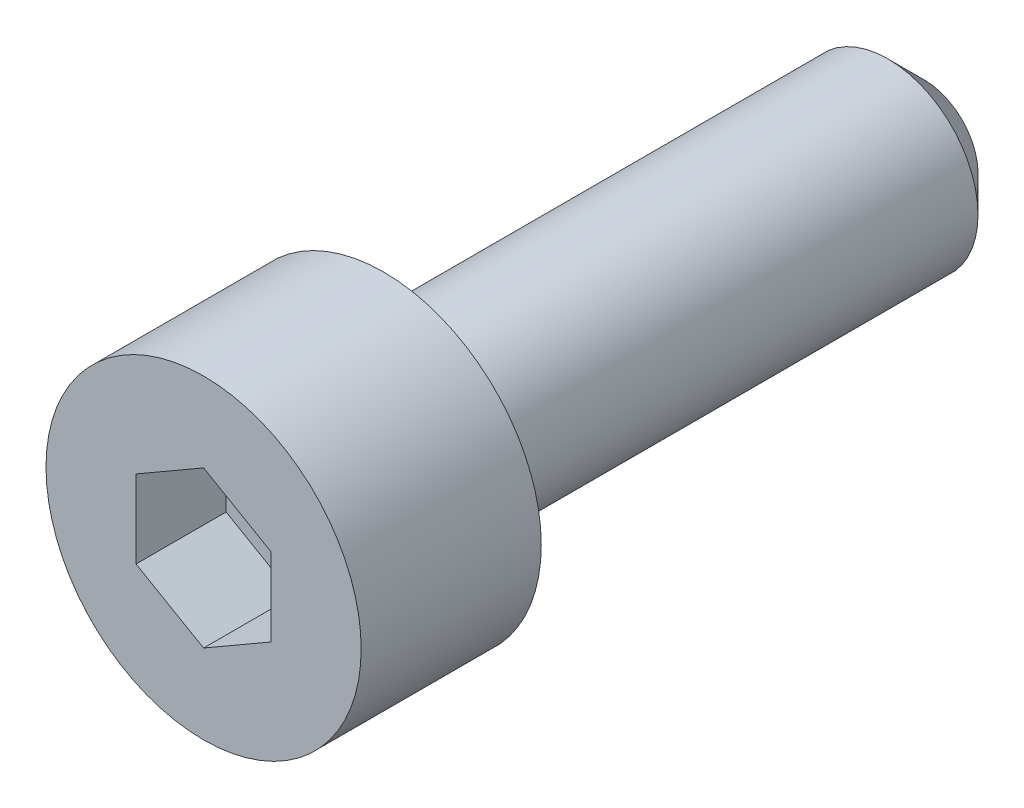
ISO-10303-21;
HEADER;
FILE_DESCRIPTION(('STEP AP214'),'2;1');
FILE_NAME('part.step','',(''),(''),'','','');
FILE_SCHEMA(('AUTOMOTIVE_DESIGN { 1 0 10303 214 1 1 1 1 }'));
ENDSEC;
DATA;
#1=APPLICATION_CONTEXT('core data for automotive mechanical design processes');
#2=APPLICATION_PROTOCOL_DEFINITION('international standard','automotive_design',2000,#1);
#3=PRODUCT_CONTEXT('',#1,'mechanical');
#4=PRODUCT('Part','Part','',(#3));
#5=PRODUCT_RELATED_PRODUCT_CATEGORY('part','',(#4));
#6=PRODUCT_DEFINITION_FORMATION('','',#4);
#7=PRODUCT_DEFINITION_CONTEXT('part definition',#1,'design');
#8=PRODUCT_DEFINITION('design','',#6,#7);
#9=PRODUCT_DEFINITION_SHAPE('','',#8);
#10=(LENGTH_UNIT() NAMED_UNIT(*) SI_UNIT(.MILLI.,.METRE.));
#11=(NAMED_UNIT(*) PLANE_ANGLE_UNIT() SI_UNIT($,.RADIAN.));
#12=(NAMED_UNIT(*) SI_UNIT($,.STERADIAN.) SOLID_ANGLE_UNIT());
#13=UNCERTAINTY_MEASURE_WITH_UNIT(LENGTH_MEASURE(1.E-05),#10,'distance_accuracy_value','');
#14=(GEOMETRIC_REPRESENTATION_CONTEXT(3) GLOBAL_UNCERTAINTY_ASSIGNED_CONTEXT((#13)) GLOBAL_UNIT_ASSIGNED_CONTEXT((#10,
#11,#12)) REPRESENTATION_CONTEXT('',''));
#15=CARTESIAN_POINT('',(0.,0.,0.));
#16=DIRECTION('',(0.,0.,1.));
#17=DIRECTION('',(1.,0.,0.));
#18=AXIS2_PLACEMENT_3D('',#15,#16,#17);
#19=CARTESIAN_POINT('',(0.,1.73205080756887,2.));
#20=DIRECTION('',(-0.5,-0.86602540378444,0.));
#21=DIRECTION('',(0.86602540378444,-0.5,0.));
#22=AXIS2_PLACEMENT_3D('',#19,#20,#21);
#23=PLANE('',#22);
#24=DIRECTION('',(0.,0.,1.));
#25=VECTOR('',#24,1.);
#26=CARTESIAN_POINT('',(1.5,0.866025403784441,2.));
#27=LINE('',#26,#25);
#28=CARTESIAN_POINT('',(1.5,0.866025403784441,2.));
#29=VERTEX_POINT('',#28);
#30=CARTESIAN_POINT('',(1.5,0.866025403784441,4.));
#31=VERTEX_POINT('',#30);
#32=EDGE_CURVE('E63',#29,#31,#27,.T.);
#33=ORIENTED_EDGE('',*,*,#32,.T.);
#34=DIRECTION('',(0.86602540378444,-0.5,0.));
#35=VECTOR('',#34,1.);
#36=CARTESIAN_POINT('',(0.,1.73205080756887,4.));
#37=LINE('',#36,#35);
#38=CARTESIAN_POINT('',(0.,1.73205080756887,4.));
#39=VERTEX_POINT('',#38);
#40=EDGE_CURVE('E29',#39,#31,#37,.T.);
#41=ORIENTED_EDGE('',*,*,#40,.F.);
#42=DIRECTION('',(0.,0.,1.));
#43=VECTOR('',#42,1.);
#44=CARTESIAN_POINT('',(0.,1.73205080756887,2.));
#45=LINE('',#44,#43);
#46=CARTESIAN_POINT('',(0.,1.73205080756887,2.));
#47=VERTEX_POINT('',#46);
#48=EDGE_CURVE('E33',#47,#39,#45,.T.);
#49=ORIENTED_EDGE('',*,*,#48,.F.);
#50=DIRECTION('',(0.86602540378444,-0.5,0.));
#51=VECTOR('',#50,1.);
#52=CARTESIAN_POINT('',(0.,1.73205080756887,2.));
#53=LINE('',#52,#51);
#54=EDGE_CURVE('E65',#47,#29,#53,.T.);
#55=ORIENTED_EDGE('',*,*,#54,.T.);
#56=EDGE_LOOP('',(#33,#41,#49,#55));
#57=FACE_BOUND('',#56,.T.);
#58=ADVANCED_FACE('F14',(#57),#23,.T.);
#59=CARTESIAN_POINT('',(1.5,-0.866025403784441,2.));
#60=DIRECTION('',(1.,0.,0.));
#61=DIRECTION('',(0.,1.,0.));
#62=AXIS2_PLACEMENT_3D('',#59,#60,#61);
#63=PLANE('',#62);
#64=DIRECTION('',(0.,0.,1.));
#65=VECTOR('',#64,1.);
#66=CARTESIAN_POINT('',(1.5,-0.866025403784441,2.));
#67=LINE('',#66,#65);
#68=CARTESIAN_POINT('',(1.5,-0.866025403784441,2.));
#69=VERTEX_POINT('',#68);
#70=CARTESIAN_POINT('',(1.5,-0.866025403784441,4.));
#71=VERTEX_POINT('',#70);
#72=EDGE_CURVE('E70',#69,#71,#67,.T.);
#73=ORIENTED_EDGE('',*,*,#72,.T.);
#74=DIRECTION('',(0.,1.,0.));
#75=VECTOR('',#74,1.);
#76=CARTESIAN_POINT('',(1.5,-0.866025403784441,4.));
#77=LINE('',#76,#75);
#78=EDGE_CURVE('E73',#71,#31,#77,.T.);
#79=ORIENTED_EDGE('',*,*,#78,.T.);
#80=ORIENTED_EDGE('',*,*,#32,.F.);
#81=DIRECTION('',(0.,1.,0.));
#82=VECTOR('',#81,1.);
#83=CARTESIAN_POINT('',(1.5,-0.866025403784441,2.));
#84=LINE('',#83,#82);
#85=EDGE_CURVE('E100',#69,#29,#84,.T.);
#86=ORIENTED_EDGE('',*,*,#85,.F.);
#87=EDGE_LOOP('',(#73,#79,#80,#86));
#88=FACE_BOUND('',#87,.T.);
#89=ADVANCED_FACE('F74',(#88),#63,.F.);
#90=CARTESIAN_POINT('',(0.,-1.73205080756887,2.));
#91=DIRECTION('',(0.5,-0.86602540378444,0.));
#92=DIRECTION('',(0.86602540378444,0.5,0.));
#93=AXIS2_PLACEMENT_3D('',#90,#91,#92);
#94=PLANE('',#93);
#95=DIRECTION('',(0.,0.,1.));
#96=VECTOR('',#95,1.);
#97=CARTESIAN_POINT('',(0.,-1.73205080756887,2.));
#98=LINE('',#97,#96);
#99=CARTESIAN_POINT('',(0.,-1.73205080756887,2.));
#100=VERTEX_POINT('',#99);
#101=CARTESIAN_POINT('',(0.,-1.73205080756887,4.));
#102=VERTEX_POINT('',#101);
#103=EDGE_CURVE('E108',#100,#102,#98,.T.);
#104=ORIENTED_EDGE('',*,*,#103,.T.);
#105=DIRECTION('',(0.86602540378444,0.5,0.));
#106=VECTOR('',#105,1.);
#107=CARTESIAN_POINT('',(0.,-1.73205080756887,4.));
#108=LINE('',#107,#106);
#109=EDGE_CURVE('E78',#102,#71,#108,.T.);
#110=ORIENTED_EDGE('',*,*,#109,.T.);
#111=ORIENTED_EDGE('',*,*,#72,.F.);
#112=DIRECTION('',(0.86602540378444,0.5,0.));
#113=VECTOR('',#112,1.);
#114=CARTESIAN_POINT('',(0.,-1.73205080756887,2.));
#115=LINE('',#114,#113);
#116=EDGE_CURVE('E97',#100,#69,#115,.T.);
#117=ORIENTED_EDGE('',*,*,#116,.F.);
#118=EDGE_LOOP('',(#104,#110,#111,#117));
#119=FACE_BOUND('',#118,.T.);
#120=ADVANCED_FACE('F141',(#119),#94,.F.);
#121=CARTESIAN_POINT('',(0.,-1.73205080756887,2.));
#122=DIRECTION('',(0.5,0.86602540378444,0.));
#123=DIRECTION('',(-0.86602540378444,0.5,0.));
#124=AXIS2_PLACEMENT_3D('',#121,#122,#123);
#125=PLANE('',#124);
#126=DIRECTION('',(0.,0.,1.));
#127=VECTOR('',#126,1.);
#128=CARTESIAN_POINT('',(-1.5,-0.866025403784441,2.));
#129=LINE('',#128,#127);
#130=CARTESIAN_POINT('',(-1.5,-0.866025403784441,2.));
#131=VERTEX_POINT('',#130);
#132=CARTESIAN_POINT('',(-1.5,-0.866025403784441,4.));
#133=VERTEX_POINT('',#132);
#134=EDGE_CURVE('E106',#131,#133,#129,.T.);
#135=ORIENTED_EDGE('',*,*,#134,.T.);
#136=DIRECTION('',(-0.86602540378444,0.5,0.));
#137=VECTOR('',#136,1.);
#138=CARTESIAN_POINT('',(0.,-1.73205080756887,4.));
#139=LINE('',#138,#137);
#140=EDGE_CURVE('E189',#102,#133,#139,.T.);
#141=ORIENTED_EDGE('',*,*,#140,.F.);
#142=ORIENTED_EDGE('',*,*,#103,.F.);
#143=DIRECTION('',(-0.86602540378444,0.5,0.));
#144=VECTOR('',#143,1.);
#145=CARTESIAN_POINT('',(0.,-1.73205080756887,2.));
#146=LINE('',#145,#144);
#147=EDGE_CURVE('E94',#100,#131,#146,.T.);
#148=ORIENTED_EDGE('',*,*,#147,.T.);
#149=EDGE_LOOP('',(#135,#141,#142,#148));
#150=FACE_BOUND('',#149,.T.);
#151=ADVANCED_FACE('F153',(#150),#125,.T.);
#152=CARTESIAN_POINT('',(-1.5,0.866025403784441,2.));
#153=DIRECTION('',(-1.,0.,0.));
#154=DIRECTION('',(0.,-1.,0.));
#155=AXIS2_PLACEMENT_3D('',#152,#153,#154);
#156=PLANE('',#155);
#157=DIRECTION('',(0.,0.,1.));
#158=VECTOR('',#157,1.);
#159=CARTESIAN_POINT('',(-1.5,0.866025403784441,2.));
#160=LINE('',#159,#158);
#161=CARTESIAN_POINT('',(-1.5,0.866025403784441,2.));
#162=VERTEX_POINT('',#161);
#163=CARTESIAN_POINT('',(-1.5,0.866025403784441,4.));
#164=VERTEX_POINT('',#163);
#165=EDGE_CURVE('E104',#162,#164,#160,.T.);
#166=ORIENTED_EDGE('',*,*,#165,.T.);
#167=DIRECTION('',(0.,-1.,0.));
#168=VECTOR('',#167,1.);
#169=CARTESIAN_POINT('',(-1.5,0.866025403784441,4.));
#170=LINE('',#169,#168);
#171=EDGE_CURVE('E190',#164,#133,#170,.T.);
#172=ORIENTED_EDGE('',*,*,#171,.T.);
#173=ORIENTED_EDGE('',*,*,#134,.F.);
#174=DIRECTION('',(0.,-1.,0.));
#175=VECTOR('',#174,1.);
#176=CARTESIAN_POINT('',(-1.5,0.866025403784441,2.));
#177=LINE('',#176,#175);
#178=EDGE_CURVE('E91',#162,#131,#177,.T.);
#179=ORIENTED_EDGE('',*,*,#178,.F.);
#180=EDGE_LOOP('',(#166,#172,#173,#179));
#181=FACE_BOUND('',#180,.T.);
#182=ADVANCED_FACE('F149',(#181),#156,.F.);
#183=CARTESIAN_POINT('',(0.,1.73205080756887,2.));
#184=DIRECTION('',(-0.5,0.86602540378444,0.));
#185=DIRECTION('',(-0.86602540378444,-0.5,0.));
#186=AXIS2_PLACEMENT_3D('',#183,#184,#185);
#187=PLANE('',#186);
#188=DIRECTION('',(-0.86602540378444,-0.5,0.));
#189=VECTOR('',#188,1.);
#190=CARTESIAN_POINT('',(0.,1.73205080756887,2.));
#191=LINE('',#190,#189);
#192=EDGE_CURVE('E88',#47,#162,#191,.T.);
#193=ORIENTED_EDGE('',*,*,#192,.F.);
#194=ORIENTED_EDGE('',*,*,#48,.T.);
#195=DIRECTION('',(-0.86602540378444,-0.5,0.));
#196=VECTOR('',#195,1.);
#197=CARTESIAN_POINT('',(0.,1.73205080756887,4.));
#198=LINE('',#197,#196);
#199=EDGE_CURVE('E84',#39,#164,#198,.T.);
#200=ORIENTED_EDGE('',*,*,#199,.T.);
#201=ORIENTED_EDGE('',*,*,#165,.F.);
#202=EDGE_LOOP('',(#193,#194,#200,#201));
#203=FACE_BOUND('',#202,.T.);
#204=ADVANCED_FACE('F146',(#203),#187,.F.);
#205=CARTESIAN_POINT('',(1.5,0.866025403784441,2.));
#206=DIRECTION('',(0.,0.,1.));
#207=DIRECTION('',(1.,0.,0.));
#208=AXIS2_PLACEMENT_3D('',#205,#206,#207);
#209=PLANE('',#208);
#210=ORIENTED_EDGE('',*,*,#54,.F.);
#211=ORIENTED_EDGE('',*,*,#192,.T.);
#212=ORIENTED_EDGE('',*,*,#178,.T.);
#213=ORIENTED_EDGE('',*,*,#147,.F.);
#214=ORIENTED_EDGE('',*,*,#116,.T.);
#215=ORIENTED_EDGE('',*,*,#85,.T.);
#216=EDGE_LOOP('',(#210,#211,#212,#213,#214,#215));
#217=FACE_BOUND('',#216,.T.);
#218=ADVANCED_FACE('F145',(#217),#209,.T.);
#219=CARTESIAN_POINT('',(0.,0.,4.));
#220=DIRECTION('',(0.,0.,1.));
#221=DIRECTION('',(1.,0.,0.));
#222=AXIS2_PLACEMENT_3D('',#219,#220,#221);
#223=PLANE('',#222);
#224=CARTESIAN_POINT('',(0.,0.,4.));
#225=DIRECTION('',(0.,0.,1.));
#226=DIRECTION('',(1.,0.,0.));
#227=AXIS2_PLACEMENT_3D('',#224,#225,#226);
#228=CIRCLE('',#227,3.5);
#229=CARTESIAN_POINT('',(3.5,0.,4.));
#230=VERTEX_POINT('',#229);
#231=EDGE_CURVE('E116',#230,#230,#228,.T.);
#232=ORIENTED_EDGE('',*,*,#231,.T.);
#233=EDGE_LOOP('',(#232));
#234=FACE_BOUND('',#233,.T.);
#235=ORIENTED_EDGE('',*,*,#199,.F.);
#236=ORIENTED_EDGE('',*,*,#40,.T.);
#237=ORIENTED_EDGE('',*,*,#78,.F.);
#238=ORIENTED_EDGE('',*,*,#109,.F.);
#239=ORIENTED_EDGE('',*,*,#140,.T.);
#240=ORIENTED_EDGE('',*,*,#171,.F.);
#241=EDGE_LOOP('',(#235,#236,#237,#238,#239,#240));
#242=FACE_BOUND('',#241,.T.);
#243=ADVANCED_FACE('F81',(#234,#242),#223,.T.);
#244=CARTESIAN_POINT('',(0.,0.,8.));
#245=DIRECTION('',(0.,0.,1.));
#246=DIRECTION('',(1.,0.,0.));
#247=AXIS2_PLACEMENT_3D('',#244,#245,#246);
#248=CYLINDRICAL_SURFACE('',#247,3.5);
#249=CARTESIAN_POINT('',(0.,0.,0.));
#250=DIRECTION('',(0.,0.,1.));
#251=DIRECTION('',(1.,0.,0.));
#252=AXIS2_PLACEMENT_3D('',#249,#250,#251);
#253=CIRCLE('',#252,3.5);
#254=CARTESIAN_POINT('',(3.5,0.,0.));
#255=VERTEX_POINT('',#254);
#256=EDGE_CURVE('E113',#255,#255,#253,.T.);
#257=ORIENTED_EDGE('',*,*,#256,.T.);
#258=EDGE_LOOP('',(#257));
#259=FACE_BOUND('',#258,.T.);
#260=ORIENTED_EDGE('',*,*,#231,.F.);
#261=EDGE_LOOP('',(#260));
#262=FACE_BOUND('',#261,.T.);
#263=ADVANCED_FACE('F166',(#259,#262),#248,.T.);
#264=CARTESIAN_POINT('',(3.5,0.,0.));
#265=DIRECTION('',(0.,0.,-1.));
#266=DIRECTION('',(-1.,0.,0.));
#267=AXIS2_PLACEMENT_3D('',#264,#265,#266);
#268=PLANE('',#267);
#269=CARTESIAN_POINT('',(0.,0.,0.));
#270=DIRECTION('',(0.,0.,1.));
#271=DIRECTION('',(1.,0.,0.));
#272=AXIS2_PLACEMENT_3D('',#269,#270,#271);
#273=CIRCLE('',#272,2.);
#274=CARTESIAN_POINT('',(2.,0.,0.));
#275=VERTEX_POINT('',#274);
#276=EDGE_CURVE('E69',#275,#275,#273,.T.);
#277=ORIENTED_EDGE('',*,*,#276,.T.);
#278=EDGE_LOOP('',(#277));
#279=FACE_BOUND('',#278,.T.);
#280=ORIENTED_EDGE('',*,*,#256,.F.);
#281=EDGE_LOOP('',(#280));
#282=FACE_BOUND('',#281,.T.);
#283=ADVANCED_FACE('F163',(#279,#282),#268,.T.);
#284=CARTESIAN_POINT('',(0.,0.,8.));
#285=DIRECTION('',(0.,0.,1.));
#286=DIRECTION('',(1.,0.,0.));
#287=AXIS2_PLACEMENT_3D('',#284,#285,#286);
#288=CYLINDRICAL_SURFACE('',#287,2.);
#289=CARTESIAN_POINT('',(0.,0.,-11.2));
#290=DIRECTION('',(0.,0.,-1.));
#291=DIRECTION('',(-1.,0.,0.));
#292=AXIS2_PLACEMENT_3D('',#289,#290,#291);
#293=CIRCLE('',#292,2.);
#294=CARTESIAN_POINT('',(-2.,0.,-11.2));
#295=VERTEX_POINT('',#294);
#296=EDGE_CURVE('E22',#295,#295,#293,.F.);
#297=ORIENTED_EDGE('',*,*,#296,.T.);
#298=EDGE_LOOP('',(#297));
#299=FACE_BOUND('',#298,.T.);
#300=ORIENTED_EDGE('',*,*,#276,.F.);
#301=EDGE_LOOP('',(#300));
#302=FACE_BOUND('',#301,.T.);
#303=ADVANCED_FACE('F121',(#299,#302),#288,.T.);
#304=CARTESIAN_POINT('',(2.,0.,-12.));
#305=DIRECTION('',(0.,0.,-1.));
#306=DIRECTION('',(-1.,0.,0.));
#307=AXIS2_PLACEMENT_3D('',#304,#305,#306);
#308=PLANE('',#307);
#309=CARTESIAN_POINT('',(0.,0.,-12.));
#310=DIRECTION('',(0.,0.,-1.));
#311=DIRECTION('',(-1.,0.,0.));
#312=AXIS2_PLACEMENT_3D('',#309,#310,#311);
#313=CIRCLE('',#312,1.2);
#314=CARTESIAN_POINT('',(-1.2,0.,-12.));
#315=VERTEX_POINT('',#314);
#316=EDGE_CURVE('E9',#315,#315,#313,.T.);
#317=ORIENTED_EDGE('',*,*,#316,.T.);
#318=EDGE_LOOP('',(#317));
#319=FACE_BOUND('',#318,.T.);
#320=ADVANCED_FACE('F125',(#319),#308,.T.);
#321=CARTESIAN_POINT('',(0.,0.,-11.2));
#322=DIRECTION('',(0.,0.,1.));
#323=DIRECTION('',(1.,0.,0.));
#324=AXIS2_PLACEMENT_3D('',#321,#322,#323);
#325=CONICAL_SURFACE('',#324,2.,0.785398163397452);
#326=ORIENTED_EDGE('',*,*,#316,.F.);
#327=EDGE_LOOP('',(#326));
#328=FACE_BOUND('',#327,.T.);
#329=ORIENTED_EDGE('',*,*,#296,.F.);
#330=EDGE_LOOP('',(#329));
#331=FACE_BOUND('',#330,.T.);
#332=ADVANCED_FACE('F16',(#328,#331),#325,.T.);
#333=CLOSED_SHELL('',(#58,#89,#120,#151,#182,#204,#218,#243,#263,#283,#303,#320,#332));
#334=MANIFOLD_SOLID_BREP('B1',#333);
#335=ADVANCED_BREP_SHAPE_REPRESENTATION('',(#18,#334),#14);
#336=SHAPE_DEFINITION_REPRESENTATION(#9,#335);
ENDSEC;
END-ISO-10303-21;
